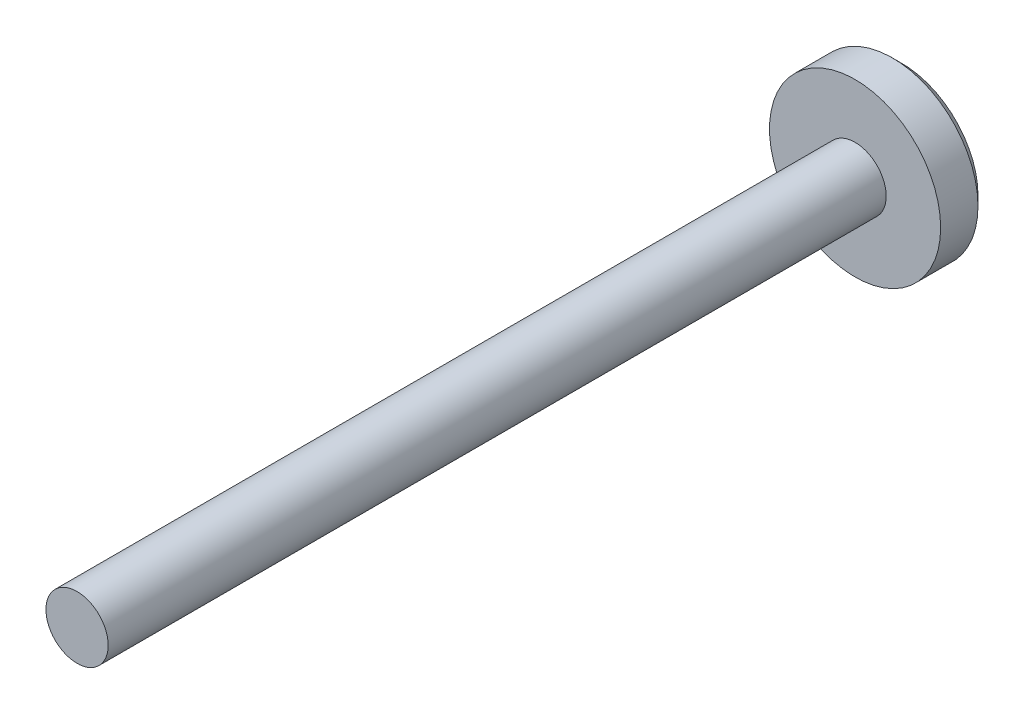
from build123d import *

# Parameters (mm, degrees)
ESQUISSE1_R          = 27.5
BASE_EXTRUSION_DEPTH = 15
ESQUISSE2_R          = 10
BOSS_EXTRU_1_DEPTH   = 250
CHANFREIN1_SIZE      = 3


with BuildPart() as part:
    # Esquisse1 → Base-Extrusion (new body)
    with BuildSketch(Plane.XY):
        Circle(ESQUISSE1_R)
    extrude(amount=BASE_EXTRUSION_DEPTH)

    # Esquisse2 → Boss.-Extru.1 (add)
    with BuildSketch(Plane.XY.offset(15)):
        Circle(ESQUISSE2_R)
    extrude(amount=BOSS_EXTRU_1_DEPTH)

    # Chanfrein1
    chanfrein1_edges = [part.edges().sort_by_distance(p)[0] for p in [
        (-27.5, 0, 0),
    ]]
    chamfer(chanfrein1_edges, length=CHANFREIN1_SIZE)


solid = part.part
